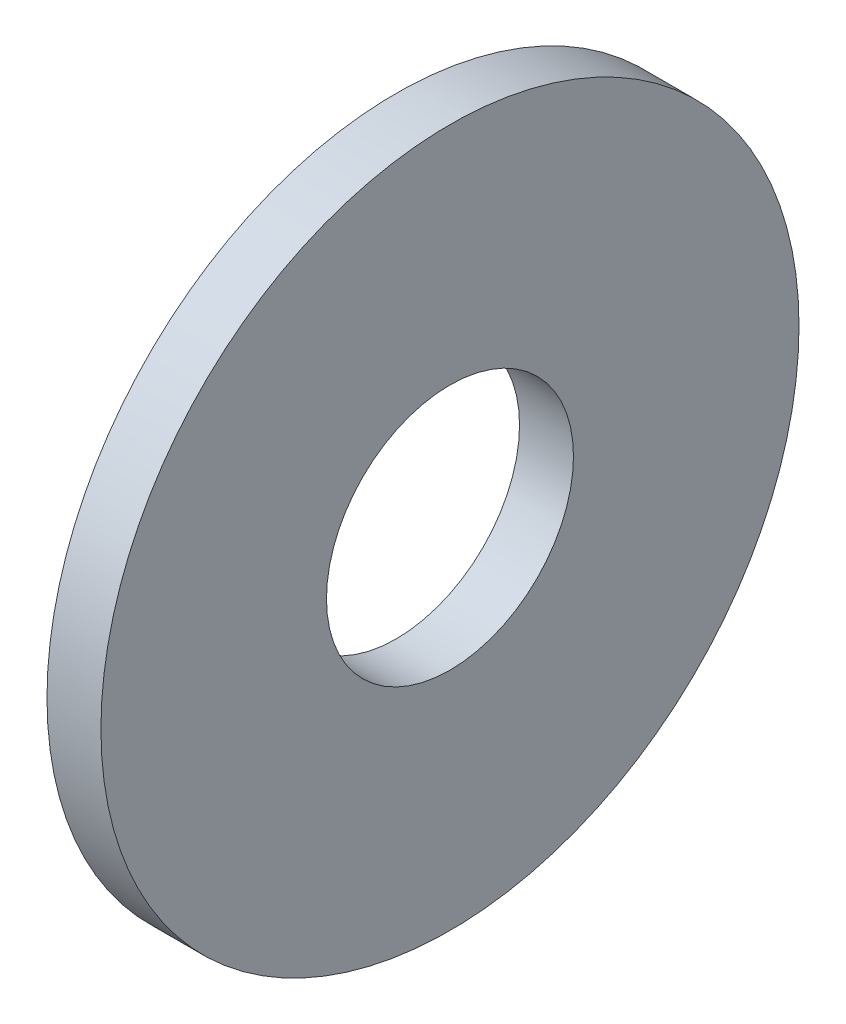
from build123d import *

# Parameters (mm, degrees)
SKETCH1_W = 8.5
SKETCH1_H = 35.54


with BuildPart() as part:
    # Sketch1 → Base-Revolve (revolve)
    with BuildSketch(Plane.XY, mode=Mode.PRIVATE) as base_revolve_sk:
        with Locations((-4.25, 37.23)):
            Rectangle(SKETCH1_W, SKETCH1_H)
    revolve(base_revolve_sk.sketch.rotate(Axis((-34.925, 0, 0), (1, 0, 0)), 90), axis=Axis((-34.925, 0, 0), (1, 0, 0)))


solid = part.part
